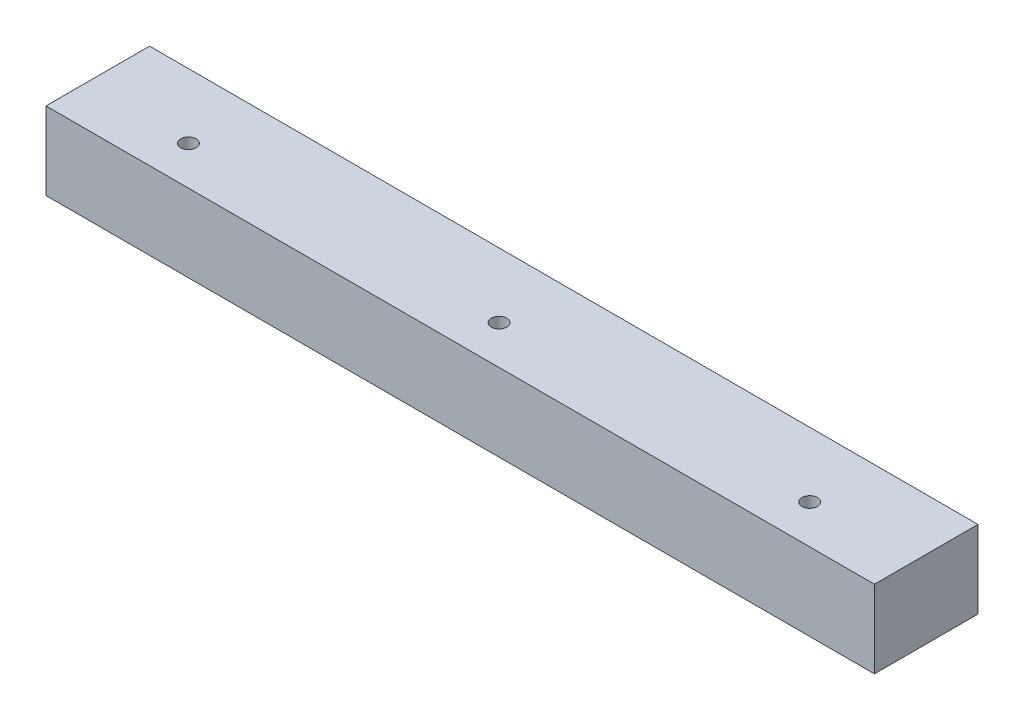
from build123d import *

# Parameters (mm, degrees)
SKETCH1_W                  = 203.2
SKETCH1_H                  = 25.4
BOSS_EXTRUDE1_DEPTH        = 19.05
TAP_DRILL_FOR_10_24_TAP1_D = 3.7973
LPATTERN1_COUNT            = 3
LPATTERN1_PITCH            = 76.2


with BuildPart() as part:
    # Sketch1 → Boss-Extrude1 (new body)
    with BuildSketch(Plane(origin=(0, 0, 0), x_dir=(1, 0, 0), z_dir=(0, 1, 0))):
        with Locations((-101.6, 12.7)):
            Rectangle(SKETCH1_W, SKETCH1_H)
    extrude(amount=BOSS_EXTRUDE1_DEPTH)

    # Tap Drill for _10-24 Tap1 (through all)
    with Locations(Plane(origin=(0, 0, 0), x_dir=(-1, 0, 0), z_dir=(0, -1, 0))):
        with Locations((25.4, 9.525)):
            tap_drill_for_10_24_tap1 = Hole(TAP_DRILL_FOR_10_24_TAP1_D / 2)

    # LPattern1: Tap Drill for _10-24 Tap1 ×3
    with Locations(*[(-i * LPATTERN1_PITCH, 0, 0) for i in range(1, LPATTERN1_COUNT)]):
        add(tap_drill_for_10_24_tap1, mode=Mode.SUBTRACT)


solid = part.part
